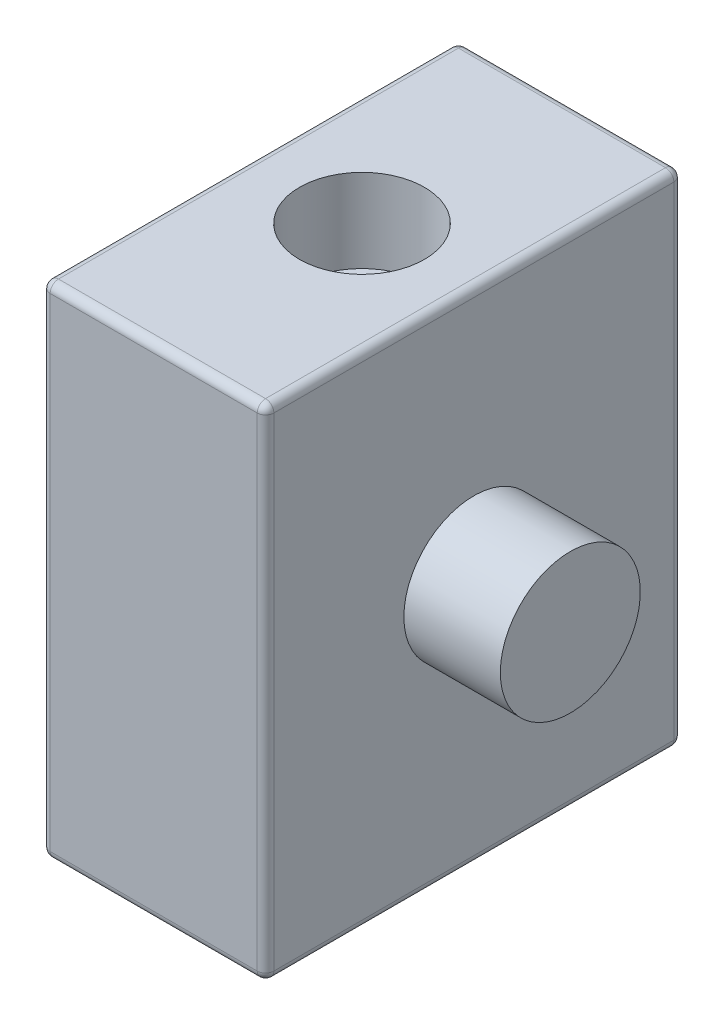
ISO-10303-21;
HEADER;
FILE_DESCRIPTION(('STEP AP214'),'2;1');
FILE_NAME('part.step','',(''),(''),'','','');
FILE_SCHEMA(('AUTOMOTIVE_DESIGN { 1 0 10303 214 1 1 1 1 }'));
ENDSEC;
DATA;
#1=APPLICATION_CONTEXT('core data for automotive mechanical design processes');
#2=APPLICATION_PROTOCOL_DEFINITION('international standard','automotive_design',2000,#1);
#3=PRODUCT_CONTEXT('',#1,'mechanical');
#4=PRODUCT('Part','Part','',(#3));
#5=PRODUCT_RELATED_PRODUCT_CATEGORY('part','',(#4));
#6=PRODUCT_DEFINITION_FORMATION('','',#4);
#7=PRODUCT_DEFINITION_CONTEXT('part definition',#1,'design');
#8=PRODUCT_DEFINITION('design','',#6,#7);
#9=PRODUCT_DEFINITION_SHAPE('','',#8);
#10=(LENGTH_UNIT() NAMED_UNIT(*) SI_UNIT(.MILLI.,.METRE.));
#11=(NAMED_UNIT(*) PLANE_ANGLE_UNIT() SI_UNIT($,.RADIAN.));
#12=(NAMED_UNIT(*) SI_UNIT($,.STERADIAN.) SOLID_ANGLE_UNIT());
#13=UNCERTAINTY_MEASURE_WITH_UNIT(LENGTH_MEASURE(1.E-05),#10,'distance_accuracy_value','');
#14=(GEOMETRIC_REPRESENTATION_CONTEXT(3) GLOBAL_UNCERTAINTY_ASSIGNED_CONTEXT((#13)) GLOBAL_UNIT_ASSIGNED_CONTEXT((#10,
#11,#12)) REPRESENTATION_CONTEXT('',''));
#15=CARTESIAN_POINT('',(0.,0.,0.));
#16=DIRECTION('',(0.,0.,1.));
#17=DIRECTION('',(1.,0.,0.));
#18=AXIS2_PLACEMENT_3D('',#15,#16,#17);
#19=CARTESIAN_POINT('',(17.05,38.1,-31.75));
#20=DIRECTION('',(0.,0.,1.));
#21=DIRECTION('',(0.,-1.,0.));
#22=AXIS2_PLACEMENT_3D('',#19,#20,#21);
#23=PLANE('',#22);
#24=DIRECTION('',(-1.,0.,0.));
#25=VECTOR('',#24,1.);
#26=CARTESIAN_POINT('',(17.05,-36.83,-31.75));
#27=LINE('',#26,#25);
#28=CARTESIAN_POINT('',(15.78,-36.83,-31.75));
#29=VERTEX_POINT('',#28);
#30=CARTESIAN_POINT('',(-15.78,-36.83,-31.75));
#31=VERTEX_POINT('',#30);
#32=EDGE_CURVE('E50',#29,#31,#27,.T.);
#33=ORIENTED_EDGE('',*,*,#32,.T.);
#34=DIRECTION('',(0.,1.,0.));
#35=VECTOR('',#34,1.);
#36=CARTESIAN_POINT('',(-15.78,38.1,-31.75));
#37=LINE('',#36,#35);
#38=CARTESIAN_POINT('',(-15.78,36.83,-31.75));
#39=VERTEX_POINT('',#38);
#40=EDGE_CURVE('E11',#31,#39,#37,.T.);
#41=ORIENTED_EDGE('',*,*,#40,.T.);
#42=DIRECTION('',(-1.,0.,0.));
#43=VECTOR('',#42,1.);
#44=CARTESIAN_POINT('',(17.05,36.83,-31.75));
#45=LINE('',#44,#43);
#46=CARTESIAN_POINT('',(15.78,36.83,-31.75));
#47=VERTEX_POINT('',#46);
#48=EDGE_CURVE('E272',#39,#47,#45,.F.);
#49=ORIENTED_EDGE('',*,*,#48,.T.);
#50=DIRECTION('',(0.,1.,0.));
#51=VECTOR('',#50,1.);
#52=CARTESIAN_POINT('',(15.78,-38.1,-31.75));
#53=LINE('',#52,#51);
#54=EDGE_CURVE('E270',#47,#29,#53,.F.);
#55=ORIENTED_EDGE('',*,*,#54,.T.);
#56=EDGE_LOOP('',(#33,#41,#49,#55));
#57=FACE_BOUND('',#56,.T.);
#58=ADVANCED_FACE('F41',(#57),#23,.F.);
#59=CARTESIAN_POINT('',(17.05,38.1,31.75));
#60=DIRECTION('',(0.,-1.,0.));
#61=DIRECTION('',(0.,0.,-1.));
#62=AXIS2_PLACEMENT_3D('',#59,#60,#61);
#63=PLANE('',#62);
#64=DIRECTION('',(0.,0.,1.));
#65=VECTOR('',#64,1.);
#66=CARTESIAN_POINT('',(-15.78,38.1,31.75));
#67=LINE('',#66,#65);
#68=CARTESIAN_POINT('',(-15.78,38.1,-30.48));
#69=VERTEX_POINT('',#68);
#70=CARTESIAN_POINT('',(-15.78,38.1,30.48));
#71=VERTEX_POINT('',#70);
#72=EDGE_CURVE('E240',#69,#71,#67,.T.);
#73=ORIENTED_EDGE('',*,*,#72,.T.);
#74=DIRECTION('',(-1.,0.,0.));
#75=VECTOR('',#74,1.);
#76=CARTESIAN_POINT('',(17.05,38.1,30.48));
#77=LINE('',#76,#75);
#78=CARTESIAN_POINT('',(15.78,38.1,30.48));
#79=VERTEX_POINT('',#78);
#80=EDGE_CURVE('E242',#71,#79,#77,.F.);
#81=ORIENTED_EDGE('',*,*,#80,.T.);
#82=DIRECTION('',(0.,0.,1.));
#83=VECTOR('',#82,1.);
#84=CARTESIAN_POINT('',(15.78,38.1,-31.75));
#85=LINE('',#84,#83);
#86=CARTESIAN_POINT('',(15.78,38.1,-30.48));
#87=VERTEX_POINT('',#86);
#88=EDGE_CURVE('E238',#79,#87,#85,.F.);
#89=ORIENTED_EDGE('',*,*,#88,.T.);
#90=DIRECTION('',(-1.,0.,0.));
#91=VECTOR('',#90,1.);
#92=CARTESIAN_POINT('',(17.05,38.1,-30.48));
#93=LINE('',#92,#91);
#94=EDGE_CURVE('E236',#87,#69,#93,.T.);
#95=ORIENTED_EDGE('',*,*,#94,.T.);
#96=EDGE_LOOP('',(#73,#81,#89,#95));
#97=FACE_BOUND('',#96,.T.);
#98=CARTESIAN_POINT('',(0.,38.1,0.));
#99=DIRECTION('',(0.,1.,0.));
#100=DIRECTION('',(0.,0.,1.));
#101=AXIS2_PLACEMENT_3D('',#98,#99,#100);
#102=CIRCLE('',#101,9.525);
#103=CARTESIAN_POINT('',(0.,38.1,9.525));
#104=VERTEX_POINT('',#103);
#105=EDGE_CURVE('E221',#104,#104,#102,.T.);
#106=ORIENTED_EDGE('',*,*,#105,.F.);
#107=EDGE_LOOP('',(#106));
#108=FACE_BOUND('',#107,.T.);
#109=ADVANCED_FACE('F300',(#97,#108),#63,.F.);
#110=CARTESIAN_POINT('',(17.05,38.1,31.75));
#111=DIRECTION('',(0.,0.,-1.));
#112=DIRECTION('',(-1.,0.,0.));
#113=AXIS2_PLACEMENT_3D('',#110,#111,#112);
#114=PLANE('',#113);
#115=DIRECTION('',(0.,-1.,0.));
#116=VECTOR('',#115,1.);
#117=CARTESIAN_POINT('',(15.78,38.1,31.75));
#118=LINE('',#117,#116);
#119=CARTESIAN_POINT('',(15.78,-36.83,31.75));
#120=VERTEX_POINT('',#119);
#121=CARTESIAN_POINT('',(15.78,36.83,31.75));
#122=VERTEX_POINT('',#121);
#123=EDGE_CURVE('E140',#120,#122,#118,.F.);
#124=ORIENTED_EDGE('',*,*,#123,.T.);
#125=DIRECTION('',(-1.,0.,0.));
#126=VECTOR('',#125,1.);
#127=CARTESIAN_POINT('',(17.05,36.83,31.75));
#128=LINE('',#127,#126);
#129=CARTESIAN_POINT('',(-15.78,36.83,31.75));
#130=VERTEX_POINT('',#129);
#131=EDGE_CURVE('E136',#122,#130,#128,.T.);
#132=ORIENTED_EDGE('',*,*,#131,.T.);
#133=DIRECTION('',(0.,-1.,0.));
#134=VECTOR('',#133,1.);
#135=CARTESIAN_POINT('',(-15.78,38.1,31.75));
#136=LINE('',#135,#134);
#137=CARTESIAN_POINT('',(-15.78,-36.83,31.75));
#138=VERTEX_POINT('',#137);
#139=EDGE_CURVE('E130',#130,#138,#136,.T.);
#140=ORIENTED_EDGE('',*,*,#139,.T.);
#141=DIRECTION('',(-1.,0.,0.));
#142=VECTOR('',#141,1.);
#143=CARTESIAN_POINT('',(17.05,-36.83,31.75));
#144=LINE('',#143,#142);
#145=EDGE_CURVE('E133',#138,#120,#144,.F.);
#146=ORIENTED_EDGE('',*,*,#145,.T.);
#147=EDGE_LOOP('',(#124,#132,#140,#146));
#148=FACE_BOUND('',#147,.T.);
#149=ADVANCED_FACE('F132',(#148),#114,.F.);
#150=CARTESIAN_POINT('',(17.05,-38.1,31.75));
#151=DIRECTION('',(0.,1.,0.));
#152=DIRECTION('',(0.,0.,1.));
#153=AXIS2_PLACEMENT_3D('',#150,#151,#152);
#154=PLANE('',#153);
#155=DIRECTION('',(0.,0.,-1.));
#156=VECTOR('',#155,1.);
#157=CARTESIAN_POINT('',(15.78,-38.1,31.75));
#158=LINE('',#157,#156);
#159=CARTESIAN_POINT('',(15.78,-38.1,-30.48));
#160=VERTEX_POINT('',#159);
#161=CARTESIAN_POINT('',(15.78,-38.1,30.48));
#162=VERTEX_POINT('',#161);
#163=EDGE_CURVE('E265',#160,#162,#158,.F.);
#164=ORIENTED_EDGE('',*,*,#163,.T.);
#165=DIRECTION('',(-1.,0.,0.));
#166=VECTOR('',#165,1.);
#167=CARTESIAN_POINT('',(17.05,-38.1,30.48));
#168=LINE('',#167,#166);
#169=CARTESIAN_POINT('',(-15.78,-38.1,30.48));
#170=VERTEX_POINT('',#169);
#171=EDGE_CURVE('E267',#162,#170,#168,.T.);
#172=ORIENTED_EDGE('',*,*,#171,.T.);
#173=DIRECTION('',(0.,0.,-1.));
#174=VECTOR('',#173,1.);
#175=CARTESIAN_POINT('',(-15.78,-38.1,31.75));
#176=LINE('',#175,#174);
#177=CARTESIAN_POINT('',(-15.78,-38.1,-30.48));
#178=VERTEX_POINT('',#177);
#179=EDGE_CURVE('E261',#170,#178,#176,.T.);
#180=ORIENTED_EDGE('',*,*,#179,.T.);
#181=DIRECTION('',(-1.,0.,0.));
#182=VECTOR('',#181,1.);
#183=CARTESIAN_POINT('',(17.05,-38.1,-30.48));
#184=LINE('',#183,#182);
#185=EDGE_CURVE('E263',#178,#160,#184,.F.);
#186=ORIENTED_EDGE('',*,*,#185,.T.);
#187=EDGE_LOOP('',(#164,#172,#180,#186));
#188=FACE_BOUND('',#187,.T.);
#189=ADVANCED_FACE('F322',(#188),#154,.F.);
#190=CARTESIAN_POINT('',(17.05,0.,0.));
#191=DIRECTION('',(1.,0.,0.));
#192=DIRECTION('',(0.,0.,-1.));
#193=AXIS2_PLACEMENT_3D('',#190,#191,#192);
#194=PLANE('',#193);
#195=DIRECTION('',(0.,0.,1.));
#196=VECTOR('',#195,1.);
#197=CARTESIAN_POINT('',(17.05,36.83,31.75));
#198=LINE('',#197,#196);
#199=CARTESIAN_POINT('',(17.05,36.83,-30.48));
#200=VERTEX_POINT('',#199);
#201=CARTESIAN_POINT('',(17.05,36.83,30.48));
#202=VERTEX_POINT('',#201);
#203=EDGE_CURVE('E247',#200,#202,#198,.T.);
#204=ORIENTED_EDGE('',*,*,#203,.T.);
#205=DIRECTION('',(0.,-1.,0.));
#206=VECTOR('',#205,1.);
#207=CARTESIAN_POINT('',(17.05,-38.1,30.48));
#208=LINE('',#207,#206);
#209=CARTESIAN_POINT('',(17.05,-36.83,30.48));
#210=VERTEX_POINT('',#209);
#211=EDGE_CURVE('E251',#202,#210,#208,.T.);
#212=ORIENTED_EDGE('',*,*,#211,.T.);
#213=DIRECTION('',(0.,0.,-1.));
#214=VECTOR('',#213,1.);
#215=CARTESIAN_POINT('',(17.05,-36.83,-31.75));
#216=LINE('',#215,#214);
#217=CARTESIAN_POINT('',(17.05,-36.83,-30.48));
#218=VERTEX_POINT('',#217);
#219=EDGE_CURVE('E249',#210,#218,#216,.T.);
#220=ORIENTED_EDGE('',*,*,#219,.T.);
#221=DIRECTION('',(0.,1.,0.));
#222=VECTOR('',#221,1.);
#223=CARTESIAN_POINT('',(17.05,38.1,-30.48));
#224=LINE('',#223,#222);
#225=EDGE_CURVE('E245',#218,#200,#224,.T.);
#226=ORIENTED_EDGE('',*,*,#225,.T.);
#227=EDGE_LOOP('',(#204,#212,#220,#226));
#228=FACE_BOUND('',#227,.T.);
#229=CARTESIAN_POINT('',(17.05,0.,0.));
#230=DIRECTION('',(-1.,0.,0.));
#231=DIRECTION('',(0.,0.,1.));
#232=AXIS2_PLACEMENT_3D('',#229,#230,#231);
#233=CIRCLE('',#232,10.668);
#234=CARTESIAN_POINT('',(17.05,0.,10.668));
#235=VERTEX_POINT('',#234);
#236=EDGE_CURVE('E210',#235,#235,#233,.T.);
#237=ORIENTED_EDGE('',*,*,#236,.T.);
#238=EDGE_LOOP('',(#237));
#239=FACE_BOUND('',#238,.T.);
#240=ADVANCED_FACE('F335',(#228,#239),#194,.T.);
#241=CARTESIAN_POINT('',(-17.05,0.,0.));
#242=DIRECTION('',(1.,0.,0.));
#243=DIRECTION('',(0.,0.,-1.));
#244=AXIS2_PLACEMENT_3D('',#241,#242,#243);
#245=PLANE('',#244);
#246=DIRECTION('',(0.,0.,-1.));
#247=VECTOR('',#246,1.);
#248=CARTESIAN_POINT('',(-17.05,-36.83,0.));
#249=LINE('',#248,#247);
#250=CARTESIAN_POINT('',(-17.05,-36.83,-30.48));
#251=VERTEX_POINT('',#250);
#252=CARTESIAN_POINT('',(-17.05,-36.83,30.48));
#253=VERTEX_POINT('',#252);
#254=EDGE_CURVE('E258',#251,#253,#249,.F.);
#255=ORIENTED_EDGE('',*,*,#254,.T.);
#256=DIRECTION('',(0.,-1.,0.));
#257=VECTOR('',#256,1.);
#258=CARTESIAN_POINT('',(-17.05,0.,30.48));
#259=LINE('',#258,#257);
#260=CARTESIAN_POINT('',(-17.05,36.83,30.48));
#261=VERTEX_POINT('',#260);
#262=EDGE_CURVE('E164',#253,#261,#259,.F.);
#263=ORIENTED_EDGE('',*,*,#262,.T.);
#264=DIRECTION('',(0.,0.,1.));
#265=VECTOR('',#264,1.);
#266=CARTESIAN_POINT('',(-17.05,36.83,0.));
#267=LINE('',#266,#265);
#268=CARTESIAN_POINT('',(-17.05,36.83,-30.48));
#269=VERTEX_POINT('',#268);
#270=EDGE_CURVE('E256',#261,#269,#267,.F.);
#271=ORIENTED_EDGE('',*,*,#270,.T.);
#272=DIRECTION('',(0.,1.,0.));
#273=VECTOR('',#272,1.);
#274=CARTESIAN_POINT('',(-17.05,0.,-30.48));
#275=LINE('',#274,#273);
#276=EDGE_CURVE('E254',#269,#251,#275,.F.);
#277=ORIENTED_EDGE('',*,*,#276,.T.);
#278=EDGE_LOOP('',(#255,#263,#271,#277));
#279=FACE_BOUND('',#278,.T.);
#280=CARTESIAN_POINT('',(-17.05,0.,0.));
#281=DIRECTION('',(-1.,0.,0.));
#282=DIRECTION('',(0.,0.,1.));
#283=AXIS2_PLACEMENT_3D('',#280,#281,#282);
#284=CIRCLE('',#283,10.668);
#285=CARTESIAN_POINT('',(-17.05,0.,10.668));
#286=VERTEX_POINT('',#285);
#287=EDGE_CURVE('E152',#286,#286,#284,.T.);
#288=ORIENTED_EDGE('',*,*,#287,.F.);
#289=EDGE_LOOP('',(#288));
#290=FACE_BOUND('',#289,.T.);
#291=ADVANCED_FACE('F315',(#279,#290),#245,.F.);
#292=CARTESIAN_POINT('',(-31.75,0.,0.));
#293=DIRECTION('',(1.,0.,0.));
#294=DIRECTION('',(0.,0.,-1.));
#295=AXIS2_PLACEMENT_3D('',#292,#293,#294);
#296=CYLINDRICAL_SURFACE('',#295,10.668);
#297=CARTESIAN_POINT('',(-31.75,0.,0.));
#298=DIRECTION('',(-1.,0.,0.));
#299=DIRECTION('',(0.,0.,1.));
#300=AXIS2_PLACEMENT_3D('',#297,#298,#299);
#301=CIRCLE('',#300,10.668);
#302=CARTESIAN_POINT('',(-31.75,0.,10.668));
#303=VERTEX_POINT('',#302);
#304=EDGE_CURVE('E227',#303,#303,#301,.T.);
#305=ORIENTED_EDGE('',*,*,#304,.F.);
#306=EDGE_LOOP('',(#305));
#307=FACE_BOUND('',#306,.T.);
#308=ORIENTED_EDGE('',*,*,#287,.T.);
#309=EDGE_LOOP('',(#308));
#310=FACE_BOUND('',#309,.T.);
#311=ADVANCED_FACE('F558',(#307,#310),#296,.T.);
#312=CARTESIAN_POINT('',(-31.75,0.,0.));
#313=DIRECTION('',(-1.,0.,0.));
#314=DIRECTION('',(0.,0.,1.));
#315=AXIS2_PLACEMENT_3D('',#312,#313,#314);
#316=PLANE('',#315);
#317=ORIENTED_EDGE('',*,*,#304,.T.);
#318=EDGE_LOOP('',(#317));
#319=FACE_BOUND('',#318,.T.);
#320=ADVANCED_FACE('F549',(#319),#316,.T.);
#321=CARTESIAN_POINT('',(0.,25.4,0.));
#322=DIRECTION('',(0.,1.,0.));
#323=DIRECTION('',(0.,0.,1.));
#324=AXIS2_PLACEMENT_3D('',#321,#322,#323);
#325=CYLINDRICAL_SURFACE('',#324,9.525);
#326=CARTESIAN_POINT('',(0.,25.4,0.));
#327=DIRECTION('',(0.,1.,0.));
#328=DIRECTION('',(0.,0.,1.));
#329=AXIS2_PLACEMENT_3D('',#326,#327,#328);
#330=CIRCLE('',#329,9.525);
#331=CARTESIAN_POINT('',(0.,25.4,9.525));
#332=VERTEX_POINT('',#331);
#333=EDGE_CURVE('E224',#332,#332,#330,.T.);
#334=ORIENTED_EDGE('',*,*,#333,.F.);
#335=EDGE_LOOP('',(#334));
#336=FACE_BOUND('',#335,.T.);
#337=ORIENTED_EDGE('',*,*,#105,.T.);
#338=EDGE_LOOP('',(#337));
#339=FACE_BOUND('',#338,.T.);
#340=ADVANCED_FACE('F540',(#336,#339),#325,.F.);
#341=CARTESIAN_POINT('',(0.,25.4,0.));
#342=DIRECTION('',(0.,1.,0.));
#343=DIRECTION('',(0.,0.,1.));
#344=AXIS2_PLACEMENT_3D('',#341,#342,#343);
#345=PLANE('',#344);
#346=ORIENTED_EDGE('',*,*,#333,.T.);
#347=EDGE_LOOP('',(#346));
#348=FACE_BOUND('',#347,.T.);
#349=ADVANCED_FACE('F531',(#348),#345,.T.);
#350=CARTESIAN_POINT('',(31.75,0.,0.));
#351=DIRECTION('',(-1.,0.,0.));
#352=DIRECTION('',(0.,0.,1.));
#353=AXIS2_PLACEMENT_3D('',#350,#351,#352);
#354=CYLINDRICAL_SURFACE('',#353,10.668);
#355=CARTESIAN_POINT('',(31.75,0.,0.));
#356=DIRECTION('',(-1.,0.,0.));
#357=DIRECTION('',(0.,0.,1.));
#358=AXIS2_PLACEMENT_3D('',#355,#356,#357);
#359=CIRCLE('',#358,10.668);
#360=CARTESIAN_POINT('',(31.75,0.,10.668));
#361=VERTEX_POINT('',#360);
#362=EDGE_CURVE('E216',#361,#361,#359,.T.);
#363=ORIENTED_EDGE('',*,*,#362,.T.);
#364=EDGE_LOOP('',(#363));
#365=FACE_BOUND('',#364,.T.);
#366=ORIENTED_EDGE('',*,*,#236,.F.);
#367=EDGE_LOOP('',(#366));
#368=FACE_BOUND('',#367,.T.);
#369=ADVANCED_FACE('F522',(#365,#368),#354,.T.);
#370=CARTESIAN_POINT('',(31.75,0.,0.));
#371=DIRECTION('',(1.,0.,0.));
#372=DIRECTION('',(0.,0.,1.));
#373=AXIS2_PLACEMENT_3D('',#370,#371,#372);
#374=PLANE('',#373);
#375=ORIENTED_EDGE('',*,*,#362,.F.);
#376=EDGE_LOOP('',(#375));
#377=FACE_BOUND('',#376,.T.);
#378=ADVANCED_FACE('F515',(#377),#374,.T.);
#379=CARTESIAN_POINT('',(17.05,-36.83,-30.48));
#380=DIRECTION('',(-1.,0.,0.));
#381=DIRECTION('',(0.,0.,1.));
#382=AXIS2_PLACEMENT_3D('',#379,#380,#381);
#383=CYLINDRICAL_SURFACE('',#382,1.27);
#384=CARTESIAN_POINT('',(15.78,-36.83,-30.48));
#385=DIRECTION('',(1.,0.,0.));
#386=DIRECTION('',(0.,0.,-1.));
#387=AXIS2_PLACEMENT_3D('',#384,#385,#386);
#388=CIRCLE('',#387,1.27);
#389=EDGE_CURVE('E45',#160,#29,#388,.T.);
#390=ORIENTED_EDGE('',*,*,#389,.F.);
#391=ORIENTED_EDGE('',*,*,#185,.F.);
#392=CARTESIAN_POINT('',(-15.78,-36.83,-30.48));
#393=DIRECTION('',(-1.,0.,0.));
#394=DIRECTION('',(0.,0.,1.));
#395=AXIS2_PLACEMENT_3D('',#392,#393,#394);
#396=CIRCLE('',#395,1.27);
#397=EDGE_CURVE('E204',#31,#178,#396,.T.);
#398=ORIENTED_EDGE('',*,*,#397,.F.);
#399=ORIENTED_EDGE('',*,*,#32,.F.);
#400=EDGE_LOOP('',(#390,#391,#398,#399));
#401=FACE_BOUND('',#400,.T.);
#402=ADVANCED_FACE('F43',(#401),#383,.T.);
#403=CARTESIAN_POINT('',(15.78,-36.83,-30.48));
#404=DIRECTION('',(0.,0.,-1.));
#405=DIRECTION('',(-1.,0.,0.));
#406=AXIS2_PLACEMENT_3D('',#403,#404,#405);
#407=SPHERICAL_SURFACE('',#406,1.27);
#408=CARTESIAN_POINT('',(15.78,-36.83,-30.48));
#409=DIRECTION('',(0.,0.,-1.));
#410=DIRECTION('',(-1.,0.,0.));
#411=AXIS2_PLACEMENT_3D('',#408,#409,#410);
#412=CIRCLE('',#411,1.27);
#413=EDGE_CURVE('E199',#160,#218,#412,.F.);
#414=ORIENTED_EDGE('',*,*,#413,.F.);
#415=ORIENTED_EDGE('',*,*,#389,.T.);
#416=CARTESIAN_POINT('',(15.78,-36.83,-30.48));
#417=DIRECTION('',(0.,-1.,0.));
#418=DIRECTION('',(0.,0.,-1.));
#419=AXIS2_PLACEMENT_3D('',#416,#417,#418);
#420=CIRCLE('',#419,1.27);
#421=EDGE_CURVE('E202',#218,#29,#420,.F.);
#422=ORIENTED_EDGE('',*,*,#421,.F.);
#423=EDGE_LOOP('',(#414,#415,#422));
#424=FACE_BOUND('',#423,.T.);
#425=ADVANCED_FACE('F352',(#424),#407,.T.);
#426=CARTESIAN_POINT('',(-15.78,-36.83,-30.48));
#427=DIRECTION('',(0.,-1.,0.));
#428=DIRECTION('',(0.,0.,-1.));
#429=AXIS2_PLACEMENT_3D('',#426,#427,#428);
#430=SPHERICAL_SURFACE('',#429,1.27);
#431=CARTESIAN_POINT('',(-15.78,-36.83,-30.48));
#432=DIRECTION('',(0.,-1.,0.));
#433=DIRECTION('',(0.,0.,-1.));
#434=AXIS2_PLACEMENT_3D('',#431,#432,#433);
#435=CIRCLE('',#434,1.27);
#436=EDGE_CURVE('E194',#31,#251,#435,.F.);
#437=ORIENTED_EDGE('',*,*,#436,.F.);
#438=ORIENTED_EDGE('',*,*,#397,.T.);
#439=CARTESIAN_POINT('',(-15.78,-36.83,-30.48));
#440=DIRECTION('',(0.,0.,-1.));
#441=DIRECTION('',(-1.,0.,0.));
#442=AXIS2_PLACEMENT_3D('',#439,#440,#441);
#443=CIRCLE('',#442,1.27);
#444=EDGE_CURVE('E196',#251,#178,#443,.F.);
#445=ORIENTED_EDGE('',*,*,#444,.F.);
#446=EDGE_LOOP('',(#437,#438,#445));
#447=FACE_BOUND('',#446,.T.);
#448=ADVANCED_FACE('F350',(#447),#430,.T.);
#449=CARTESIAN_POINT('',(15.78,0.,-30.48));
#450=DIRECTION('',(0.,-1.,0.));
#451=DIRECTION('',(0.,0.,-1.));
#452=AXIS2_PLACEMENT_3D('',#449,#450,#451);
#453=CYLINDRICAL_SURFACE('',#452,1.27);
#454=ORIENTED_EDGE('',*,*,#421,.T.);
#455=ORIENTED_EDGE('',*,*,#54,.F.);
#456=CARTESIAN_POINT('',(15.78,36.83,-30.48));
#457=DIRECTION('',(0.,1.,0.));
#458=DIRECTION('',(0.,0.,1.));
#459=AXIS2_PLACEMENT_3D('',#456,#457,#458);
#460=CIRCLE('',#459,1.27);
#461=EDGE_CURVE('E188',#200,#47,#460,.T.);
#462=ORIENTED_EDGE('',*,*,#461,.F.);
#463=ORIENTED_EDGE('',*,*,#225,.F.);
#464=EDGE_LOOP('',(#454,#455,#462,#463));
#465=FACE_BOUND('',#464,.T.);
#466=ADVANCED_FACE('F340',(#465),#453,.T.);
#467=CARTESIAN_POINT('',(15.78,-36.83,0.));
#468=DIRECTION('',(0.,0.,1.));
#469=DIRECTION('',(1.,0.,0.));
#470=AXIS2_PLACEMENT_3D('',#467,#468,#469);
#471=CYLINDRICAL_SURFACE('',#470,1.27);
#472=ORIENTED_EDGE('',*,*,#413,.T.);
#473=ORIENTED_EDGE('',*,*,#219,.F.);
#474=CARTESIAN_POINT('',(15.78,-36.83,30.48));
#475=DIRECTION('',(0.,0.,1.));
#476=DIRECTION('',(1.,0.,0.));
#477=AXIS2_PLACEMENT_3D('',#474,#475,#476);
#478=CIRCLE('',#477,1.27);
#479=EDGE_CURVE('E185',#162,#210,#478,.T.);
#480=ORIENTED_EDGE('',*,*,#479,.F.);
#481=ORIENTED_EDGE('',*,*,#163,.F.);
#482=EDGE_LOOP('',(#472,#473,#480,#481));
#483=FACE_BOUND('',#482,.T.);
#484=ADVANCED_FACE('F327',(#483),#471,.T.);
#485=CARTESIAN_POINT('',(17.05,-36.83,30.48));
#486=DIRECTION('',(-1.,0.,0.));
#487=DIRECTION('',(0.,0.,1.));
#488=AXIS2_PLACEMENT_3D('',#485,#486,#487);
#489=CYLINDRICAL_SURFACE('',#488,1.27);
#490=CARTESIAN_POINT('',(-15.78,-36.83,30.48));
#491=DIRECTION('',(-1.,0.,0.));
#492=DIRECTION('',(0.,0.,1.));
#493=AXIS2_PLACEMENT_3D('',#490,#491,#492);
#494=CIRCLE('',#493,1.27);
#495=EDGE_CURVE('E147',#170,#138,#494,.T.);
#496=ORIENTED_EDGE('',*,*,#495,.F.);
#497=ORIENTED_EDGE('',*,*,#171,.F.);
#498=CARTESIAN_POINT('',(15.78,-36.83,30.48));
#499=DIRECTION('',(1.,0.,0.));
#500=DIRECTION('',(0.,0.,-1.));
#501=AXIS2_PLACEMENT_3D('',#498,#499,#500);
#502=CIRCLE('',#501,1.27);
#503=EDGE_CURVE('E150',#120,#162,#502,.T.);
#504=ORIENTED_EDGE('',*,*,#503,.F.);
#505=ORIENTED_EDGE('',*,*,#145,.F.);
#506=EDGE_LOOP('',(#496,#497,#504,#505));
#507=FACE_BOUND('',#506,.T.);
#508=ADVANCED_FACE('F145',(#507),#489,.T.);
#509=CARTESIAN_POINT('',(-15.78,-36.83,31.75));
#510=DIRECTION('',(0.,0.,-1.));
#511=DIRECTION('',(-1.,0.,0.));
#512=AXIS2_PLACEMENT_3D('',#509,#510,#511);
#513=CYLINDRICAL_SURFACE('',#512,1.27);
#514=ORIENTED_EDGE('',*,*,#444,.T.);
#515=ORIENTED_EDGE('',*,*,#179,.F.);
#516=CARTESIAN_POINT('',(-15.78,-36.83,30.48));
#517=DIRECTION('',(0.,0.,1.));
#518=DIRECTION('',(1.,0.,0.));
#519=AXIS2_PLACEMENT_3D('',#516,#517,#518);
#520=CIRCLE('',#519,1.27);
#521=EDGE_CURVE('E160',#253,#170,#520,.T.);
#522=ORIENTED_EDGE('',*,*,#521,.F.);
#523=ORIENTED_EDGE('',*,*,#254,.F.);
#524=EDGE_LOOP('',(#514,#515,#522,#523));
#525=FACE_BOUND('',#524,.T.);
#526=ADVANCED_FACE('F319',(#525),#513,.T.);
#527=CARTESIAN_POINT('',(-15.78,38.1,-30.48));
#528=DIRECTION('',(0.,1.,0.));
#529=DIRECTION('',(0.,0.,1.));
#530=AXIS2_PLACEMENT_3D('',#527,#528,#529);
#531=CYLINDRICAL_SURFACE('',#530,1.27);
#532=ORIENTED_EDGE('',*,*,#436,.T.);
#533=ORIENTED_EDGE('',*,*,#276,.F.);
#534=CARTESIAN_POINT('',(-15.78,36.83,-30.48));
#535=DIRECTION('',(0.,1.,0.));
#536=DIRECTION('',(0.,0.,1.));
#537=AXIS2_PLACEMENT_3D('',#534,#535,#536);
#538=CIRCLE('',#537,1.27);
#539=EDGE_CURVE('E180',#39,#269,#538,.T.);
#540=ORIENTED_EDGE('',*,*,#539,.F.);
#541=ORIENTED_EDGE('',*,*,#40,.F.);
#542=EDGE_LOOP('',(#532,#533,#540,#541));
#543=FACE_BOUND('',#542,.T.);
#544=ADVANCED_FACE('F349',(#543),#531,.T.);
#545=CARTESIAN_POINT('',(17.05,36.83,-30.48));
#546=DIRECTION('',(-1.,0.,0.));
#547=DIRECTION('',(0.,0.,1.));
#548=AXIS2_PLACEMENT_3D('',#545,#546,#547);
#549=CYLINDRICAL_SURFACE('',#548,1.27);
#550=CARTESIAN_POINT('',(15.78,36.83,-30.48));
#551=DIRECTION('',(1.,0.,0.));
#552=DIRECTION('',(0.,0.,-1.));
#553=AXIS2_PLACEMENT_3D('',#550,#551,#552);
#554=CIRCLE('',#553,1.27);
#555=EDGE_CURVE('E191',#47,#87,#554,.T.);
#556=ORIENTED_EDGE('',*,*,#555,.F.);
#557=ORIENTED_EDGE('',*,*,#48,.F.);
#558=CARTESIAN_POINT('',(-15.78,36.83,-30.48));
#559=DIRECTION('',(-1.,0.,0.));
#560=DIRECTION('',(0.,0.,1.));
#561=AXIS2_PLACEMENT_3D('',#558,#559,#560);
#562=CIRCLE('',#561,1.27);
#563=EDGE_CURVE('E177',#69,#39,#562,.T.);
#564=ORIENTED_EDGE('',*,*,#563,.F.);
#565=ORIENTED_EDGE('',*,*,#94,.F.);
#566=EDGE_LOOP('',(#556,#557,#564,#565));
#567=FACE_BOUND('',#566,.T.);
#568=ADVANCED_FACE('F345',(#567),#549,.T.);
#569=CARTESIAN_POINT('',(15.78,36.83,-30.48));
#570=DIRECTION('',(0.,0.,-1.));
#571=DIRECTION('',(-1.,0.,0.));
#572=AXIS2_PLACEMENT_3D('',#569,#570,#571);
#573=SPHERICAL_SURFACE('',#572,1.27);
#574=ORIENTED_EDGE('',*,*,#461,.T.);
#575=ORIENTED_EDGE('',*,*,#555,.T.);
#576=CARTESIAN_POINT('',(15.78,36.83,-30.48));
#577=DIRECTION('',(0.,0.,-1.));
#578=DIRECTION('',(-1.,0.,0.));
#579=AXIS2_PLACEMENT_3D('',#576,#577,#578);
#580=CIRCLE('',#579,1.27);
#581=EDGE_CURVE('E168',#200,#87,#580,.F.);
#582=ORIENTED_EDGE('',*,*,#581,.F.);
#583=EDGE_LOOP('',(#574,#575,#582));
#584=FACE_BOUND('',#583,.T.);
#585=ADVANCED_FACE('F343',(#584),#573,.T.);
#586=CARTESIAN_POINT('',(15.78,-36.83,30.48));
#587=DIRECTION('',(0.,-1.,0.));
#588=DIRECTION('',(0.,0.,-1.));
#589=AXIS2_PLACEMENT_3D('',#586,#587,#588);
#590=SPHERICAL_SURFACE('',#589,1.27);
#591=ORIENTED_EDGE('',*,*,#503,.T.);
#592=ORIENTED_EDGE('',*,*,#479,.T.);
#593=CARTESIAN_POINT('',(15.78,-36.83,30.48));
#594=DIRECTION('',(0.,-1.,0.));
#595=DIRECTION('',(0.,0.,-1.));
#596=AXIS2_PLACEMENT_3D('',#593,#594,#595);
#597=CIRCLE('',#596,1.27);
#598=EDGE_CURVE('E165',#120,#210,#597,.F.);
#599=ORIENTED_EDGE('',*,*,#598,.F.);
#600=EDGE_LOOP('',(#591,#592,#599));
#601=FACE_BOUND('',#600,.T.);
#602=ADVANCED_FACE('F329',(#601),#590,.T.);
#603=CARTESIAN_POINT('',(-15.78,-36.83,30.48));
#604=DIRECTION('',(0.,-1.,0.));
#605=DIRECTION('',(0.,0.,-1.));
#606=AXIS2_PLACEMENT_3D('',#603,#604,#605);
#607=SPHERICAL_SURFACE('',#606,1.27);
#608=ORIENTED_EDGE('',*,*,#521,.T.);
#609=ORIENTED_EDGE('',*,*,#495,.T.);
#610=CARTESIAN_POINT('',(-15.78,-36.83,30.48));
#611=DIRECTION('',(0.,-1.,0.));
#612=DIRECTION('',(0.,0.,-1.));
#613=AXIS2_PLACEMENT_3D('',#610,#611,#612);
#614=CIRCLE('',#613,1.27);
#615=EDGE_CURVE('E157',#253,#138,#614,.F.);
#616=ORIENTED_EDGE('',*,*,#615,.F.);
#617=EDGE_LOOP('',(#608,#609,#616));
#618=FACE_BOUND('',#617,.T.);
#619=ADVANCED_FACE('F156',(#618),#607,.T.);
#620=CARTESIAN_POINT('',(-15.78,36.83,-30.48));
#621=DIRECTION('',(0.,0.,-1.));
#622=DIRECTION('',(-1.,0.,0.));
#623=AXIS2_PLACEMENT_3D('',#620,#621,#622);
#624=SPHERICAL_SURFACE('',#623,1.27);
#625=ORIENTED_EDGE('',*,*,#563,.T.);
#626=ORIENTED_EDGE('',*,*,#539,.T.);
#627=CARTESIAN_POINT('',(-15.78,36.83,-30.48));
#628=DIRECTION('',(0.,0.,-1.));
#629=DIRECTION('',(-1.,0.,0.));
#630=AXIS2_PLACEMENT_3D('',#627,#628,#629);
#631=CIRCLE('',#630,1.27);
#632=EDGE_CURVE('E166',#69,#269,#631,.F.);
#633=ORIENTED_EDGE('',*,*,#632,.F.);
#634=EDGE_LOOP('',(#625,#626,#633));
#635=FACE_BOUND('',#634,.T.);
#636=ADVANCED_FACE('F348',(#635),#624,.T.);
#637=CARTESIAN_POINT('',(15.78,36.83,0.));
#638=DIRECTION('',(0.,0.,-1.));
#639=DIRECTION('',(-1.,0.,0.));
#640=AXIS2_PLACEMENT_3D('',#637,#638,#639);
#641=CYLINDRICAL_SURFACE('',#640,1.27);
#642=ORIENTED_EDGE('',*,*,#581,.T.);
#643=ORIENTED_EDGE('',*,*,#88,.F.);
#644=CARTESIAN_POINT('',(15.78,36.83,30.48));
#645=DIRECTION('',(0.,0.,1.));
#646=DIRECTION('',(1.,0.,0.));
#647=AXIS2_PLACEMENT_3D('',#644,#645,#646);
#648=CIRCLE('',#647,1.27);
#649=EDGE_CURVE('E171',#202,#79,#648,.T.);
#650=ORIENTED_EDGE('',*,*,#649,.F.);
#651=ORIENTED_EDGE('',*,*,#203,.F.);
#652=EDGE_LOOP('',(#642,#643,#650,#651));
#653=FACE_BOUND('',#652,.T.);
#654=ADVANCED_FACE('F295',(#653),#641,.T.);
#655=CARTESIAN_POINT('',(15.78,0.,30.48));
#656=DIRECTION('',(0.,1.,0.));
#657=DIRECTION('',(0.,0.,1.));
#658=AXIS2_PLACEMENT_3D('',#655,#656,#657);
#659=CYLINDRICAL_SURFACE('',#658,1.27);
#660=ORIENTED_EDGE('',*,*,#598,.T.);
#661=ORIENTED_EDGE('',*,*,#211,.F.);
#662=CARTESIAN_POINT('',(15.78,36.83,30.48));
#663=DIRECTION('',(0.,1.,0.));
#664=DIRECTION('',(0.,0.,1.));
#665=AXIS2_PLACEMENT_3D('',#662,#663,#664);
#666=CIRCLE('',#665,1.27);
#667=EDGE_CURVE('E284',#122,#202,#666,.T.);
#668=ORIENTED_EDGE('',*,*,#667,.F.);
#669=ORIENTED_EDGE('',*,*,#123,.F.);
#670=EDGE_LOOP('',(#660,#661,#668,#669));
#671=FACE_BOUND('',#670,.T.);
#672=ADVANCED_FACE('F333',(#671),#659,.T.);
#673=CARTESIAN_POINT('',(-15.78,38.1,30.48));
#674=DIRECTION('',(0.,-1.,0.));
#675=DIRECTION('',(0.,0.,-1.));
#676=AXIS2_PLACEMENT_3D('',#673,#674,#675);
#677=CYLINDRICAL_SURFACE('',#676,1.27);
#678=ORIENTED_EDGE('',*,*,#615,.T.);
#679=ORIENTED_EDGE('',*,*,#139,.F.);
#680=CARTESIAN_POINT('',(-15.78,36.83,30.48));
#681=DIRECTION('',(0.,1.,0.));
#682=DIRECTION('',(0.,0.,1.));
#683=AXIS2_PLACEMENT_3D('',#680,#681,#682);
#684=CIRCLE('',#683,1.27);
#685=EDGE_CURVE('E281',#261,#130,#684,.T.);
#686=ORIENTED_EDGE('',*,*,#685,.F.);
#687=ORIENTED_EDGE('',*,*,#262,.F.);
#688=EDGE_LOOP('',(#678,#679,#686,#687));
#689=FACE_BOUND('',#688,.T.);
#690=ADVANCED_FACE('F162',(#689),#677,.T.);
#691=CARTESIAN_POINT('',(-15.78,36.83,31.75));
#692=DIRECTION('',(0.,0.,1.));
#693=DIRECTION('',(1.,0.,0.));
#694=AXIS2_PLACEMENT_3D('',#691,#692,#693);
#695=CYLINDRICAL_SURFACE('',#694,1.27);
#696=ORIENTED_EDGE('',*,*,#632,.T.);
#697=ORIENTED_EDGE('',*,*,#270,.F.);
#698=CARTESIAN_POINT('',(-15.78,36.83,30.48));
#699=DIRECTION('',(0.,0.,1.));
#700=DIRECTION('',(1.,0.,0.));
#701=AXIS2_PLACEMENT_3D('',#698,#699,#700);
#702=CIRCLE('',#701,1.27);
#703=EDGE_CURVE('E279',#71,#261,#702,.T.);
#704=ORIENTED_EDGE('',*,*,#703,.F.);
#705=ORIENTED_EDGE('',*,*,#72,.F.);
#706=EDGE_LOOP('',(#696,#697,#704,#705));
#707=FACE_BOUND('',#706,.T.);
#708=ADVANCED_FACE('F311',(#707),#695,.T.);
#709=CARTESIAN_POINT('',(15.78,36.83,30.48));
#710=DIRECTION('',(1.,0.,0.));
#711=DIRECTION('',(0.,0.,-1.));
#712=AXIS2_PLACEMENT_3D('',#709,#710,#711);
#713=SPHERICAL_SURFACE('',#712,1.27);
#714=ORIENTED_EDGE('',*,*,#667,.T.);
#715=ORIENTED_EDGE('',*,*,#649,.T.);
#716=CARTESIAN_POINT('',(15.78,36.83,30.48));
#717=DIRECTION('',(1.,0.,0.));
#718=DIRECTION('',(0.,0.,-1.));
#719=AXIS2_PLACEMENT_3D('',#716,#717,#718);
#720=CIRCLE('',#719,1.27);
#721=EDGE_CURVE('E277',#122,#79,#720,.F.);
#722=ORIENTED_EDGE('',*,*,#721,.F.);
#723=EDGE_LOOP('',(#714,#715,#722));
#724=FACE_BOUND('',#723,.T.);
#725=ADVANCED_FACE('F291',(#724),#713,.T.);
#726=CARTESIAN_POINT('',(-15.78,36.83,30.48));
#727=DIRECTION('',(-1.,0.,0.));
#728=DIRECTION('',(0.,0.,1.));
#729=AXIS2_PLACEMENT_3D('',#726,#727,#728);
#730=SPHERICAL_SURFACE('',#729,1.27);
#731=ORIENTED_EDGE('',*,*,#703,.T.);
#732=ORIENTED_EDGE('',*,*,#685,.T.);
#733=CARTESIAN_POINT('',(-15.78,36.83,30.48));
#734=DIRECTION('',(-1.,0.,0.));
#735=DIRECTION('',(0.,0.,1.));
#736=AXIS2_PLACEMENT_3D('',#733,#734,#735);
#737=CIRCLE('',#736,1.27);
#738=EDGE_CURVE('E275',#71,#130,#737,.F.);
#739=ORIENTED_EDGE('',*,*,#738,.F.);
#740=EDGE_LOOP('',(#731,#732,#739));
#741=FACE_BOUND('',#740,.T.);
#742=ADVANCED_FACE('F308',(#741),#730,.T.);
#743=CARTESIAN_POINT('',(17.05,36.83,30.48));
#744=DIRECTION('',(-1.,0.,0.));
#745=DIRECTION('',(0.,0.,1.));
#746=AXIS2_PLACEMENT_3D('',#743,#744,#745);
#747=CYLINDRICAL_SURFACE('',#746,1.27);
#748=ORIENTED_EDGE('',*,*,#721,.T.);
#749=ORIENTED_EDGE('',*,*,#80,.F.);
#750=ORIENTED_EDGE('',*,*,#738,.T.);
#751=ORIENTED_EDGE('',*,*,#131,.F.);
#752=EDGE_LOOP('',(#748,#749,#750,#751));
#753=FACE_BOUND('',#752,.T.);
#754=ADVANCED_FACE('F306',(#753),#747,.T.);
#755=CLOSED_SHELL('',(#58,#109,#149,#189,#240,#291,#311,#320,#340,#349,#369,#378,#402,#425,#448,
#466,#484,#508,#526,#544,#568,#585,#602,#619,#636,#654,#672,#690,#708,#725,#742,#754));
#756=MANIFOLD_SOLID_BREP('B2',#755);
#757=ADVANCED_BREP_SHAPE_REPRESENTATION('',(#18,#756),#14);
#758=SHAPE_DEFINITION_REPRESENTATION(#9,#757);
ENDSEC;
END-ISO-10303-21;
